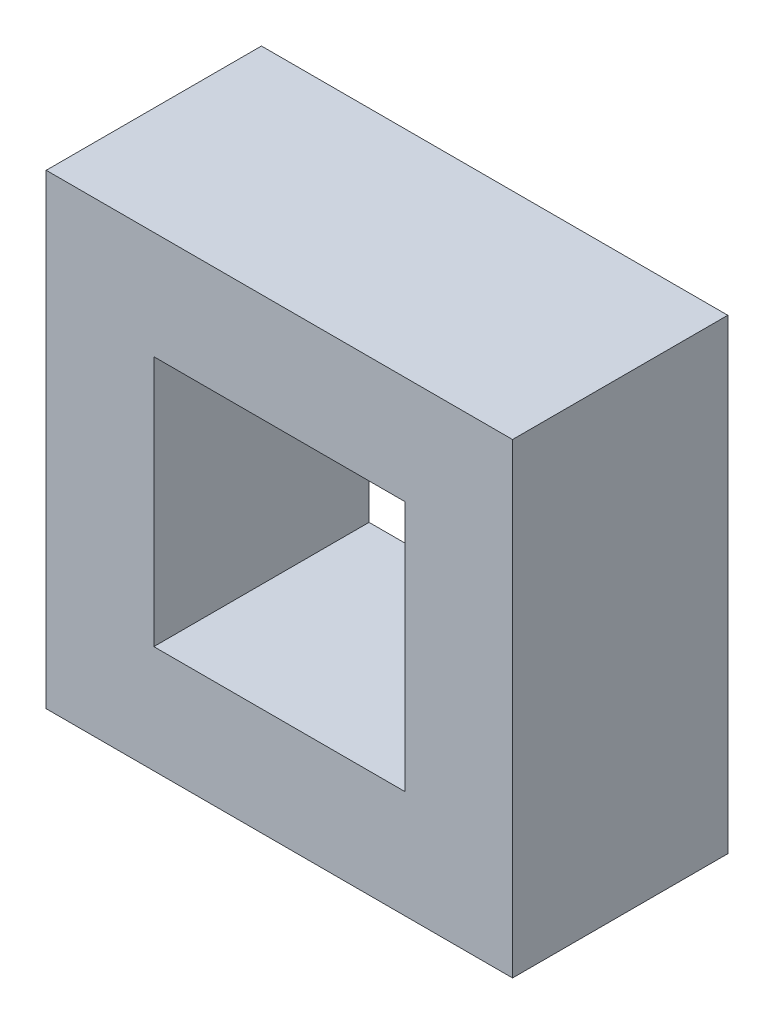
ISO-10303-21;
HEADER;
FILE_DESCRIPTION(('STEP AP214'),'2;1');
FILE_NAME('part.step','',(''),(''),'','','');
FILE_SCHEMA(('AUTOMOTIVE_DESIGN { 1 0 10303 214 1 1 1 1 }'));
ENDSEC;
DATA;
#1=APPLICATION_CONTEXT('core data for automotive mechanical design processes');
#2=APPLICATION_PROTOCOL_DEFINITION('international standard','automotive_design',2000,#1);
#3=PRODUCT_CONTEXT('',#1,'mechanical');
#4=PRODUCT('Part','Part','',(#3));
#5=PRODUCT_RELATED_PRODUCT_CATEGORY('part','',(#4));
#6=PRODUCT_DEFINITION_FORMATION('','',#4);
#7=PRODUCT_DEFINITION_CONTEXT('part definition',#1,'design');
#8=PRODUCT_DEFINITION('design','',#6,#7);
#9=PRODUCT_DEFINITION_SHAPE('','',#8);
#10=(LENGTH_UNIT() NAMED_UNIT(*) SI_UNIT(.MILLI.,.METRE.));
#11=(NAMED_UNIT(*) PLANE_ANGLE_UNIT() SI_UNIT($,.RADIAN.));
#12=(NAMED_UNIT(*) SI_UNIT($,.STERADIAN.) SOLID_ANGLE_UNIT());
#13=UNCERTAINTY_MEASURE_WITH_UNIT(LENGTH_MEASURE(1.E-05),#10,'distance_accuracy_value','');
#14=(GEOMETRIC_REPRESENTATION_CONTEXT(3) GLOBAL_UNCERTAINTY_ASSIGNED_CONTEXT((#13)) GLOBAL_UNIT_ASSIGNED_CONTEXT((#10,
#11,#12)) REPRESENTATION_CONTEXT('',''));
#15=CARTESIAN_POINT('',(0.,0.,0.));
#16=DIRECTION('',(0.,0.,1.));
#17=DIRECTION('',(1.,0.,0.));
#18=AXIS2_PLACEMENT_3D('',#15,#16,#17);
#19=CARTESIAN_POINT('',(330.2,-330.2,304.8));
#20=DIRECTION('',(0.,0.,1.));
#21=DIRECTION('',(1.,0.,0.));
#22=AXIS2_PLACEMENT_3D('',#19,#20,#21);
#23=PLANE('',#22);
#24=DIRECTION('',(0.,1.,0.));
#25=VECTOR('',#24,1.);
#26=CARTESIAN_POINT('',(330.2,330.2,304.8));
#27=LINE('',#26,#25);
#28=CARTESIAN_POINT('',(330.2,-330.2,304.8));
#29=VERTEX_POINT('',#28);
#30=CARTESIAN_POINT('',(330.2,330.2,304.8));
#31=VERTEX_POINT('',#30);
#32=EDGE_CURVE('E132',#29,#31,#27,.T.);
#33=ORIENTED_EDGE('',*,*,#32,.T.);
#34=DIRECTION('',(-1.,0.,0.));
#35=VECTOR('',#34,1.);
#36=CARTESIAN_POINT('',(-330.2,330.2,304.8));
#37=LINE('',#36,#35);
#38=CARTESIAN_POINT('',(-330.2,330.2,304.8));
#39=VERTEX_POINT('',#38);
#40=EDGE_CURVE('E135',#31,#39,#37,.T.);
#41=ORIENTED_EDGE('',*,*,#40,.T.);
#42=DIRECTION('',(0.,-1.,0.));
#43=VECTOR('',#42,1.);
#44=CARTESIAN_POINT('',(-330.2,330.2,304.8));
#45=LINE('',#44,#43);
#46=CARTESIAN_POINT('',(-330.2,-330.2,304.8));
#47=VERTEX_POINT('',#46);
#48=EDGE_CURVE('E138',#39,#47,#45,.T.);
#49=ORIENTED_EDGE('',*,*,#48,.T.);
#50=DIRECTION('',(1.,0.,0.));
#51=VECTOR('',#50,1.);
#52=CARTESIAN_POINT('',(-330.2,-330.2,304.8));
#53=LINE('',#52,#51);
#54=EDGE_CURVE('E140',#47,#29,#53,.T.);
#55=ORIENTED_EDGE('',*,*,#54,.T.);
#56=EDGE_LOOP('',(#33,#41,#49,#55));
#57=FACE_BOUND('',#56,.T.);
#58=DIRECTION('',(-1.,0.,0.));
#59=VECTOR('',#58,1.);
#60=CARTESIAN_POINT('',(-177.8,177.8,304.8));
#61=LINE('',#60,#59);
#62=CARTESIAN_POINT('',(177.8,177.8,304.8));
#63=VERTEX_POINT('',#62);
#64=CARTESIAN_POINT('',(-177.8,177.8,304.8));
#65=VERTEX_POINT('',#64);
#66=EDGE_CURVE('E104',#63,#65,#61,.T.);
#67=ORIENTED_EDGE('',*,*,#66,.F.);
#68=DIRECTION('',(0.,1.,0.));
#69=VECTOR('',#68,1.);
#70=CARTESIAN_POINT('',(177.8,177.8,304.8));
#71=LINE('',#70,#69);
#72=CARTESIAN_POINT('',(177.8,-177.8,304.8));
#73=VERTEX_POINT('',#72);
#74=EDGE_CURVE('E96',#73,#63,#71,.T.);
#75=ORIENTED_EDGE('',*,*,#74,.F.);
#76=DIRECTION('',(1.,0.,0.));
#77=VECTOR('',#76,1.);
#78=CARTESIAN_POINT('',(-177.8,-177.8,304.8));
#79=LINE('',#78,#77);
#80=CARTESIAN_POINT('',(-177.8,-177.8,304.8));
#81=VERTEX_POINT('',#80);
#82=EDGE_CURVE('E118',#81,#73,#79,.T.);
#83=ORIENTED_EDGE('',*,*,#82,.F.);
#84=DIRECTION('',(0.,-1.,0.));
#85=VECTOR('',#84,1.);
#86=CARTESIAN_POINT('',(-177.8,177.8,304.8));
#87=LINE('',#86,#85);
#88=EDGE_CURVE('E116',#65,#81,#87,.T.);
#89=ORIENTED_EDGE('',*,*,#88,.F.);
#90=EDGE_LOOP('',(#67,#75,#83,#89));
#91=FACE_BOUND('',#90,.T.);
#92=ADVANCED_FACE('F31',(#57,#91),#23,.T.);
#93=CARTESIAN_POINT('',(330.2,-330.2,0.));
#94=DIRECTION('',(0.,0.,1.));
#95=DIRECTION('',(1.,0.,0.));
#96=AXIS2_PLACEMENT_3D('',#93,#94,#95);
#97=PLANE('',#96);
#98=DIRECTION('',(0.,1.,0.));
#99=VECTOR('',#98,1.);
#100=CARTESIAN_POINT('',(330.2,330.2,0.));
#101=LINE('',#100,#99);
#102=CARTESIAN_POINT('',(330.2,-330.2,0.));
#103=VERTEX_POINT('',#102);
#104=CARTESIAN_POINT('',(330.2,330.2,0.));
#105=VERTEX_POINT('',#104);
#106=EDGE_CURVE('E112',#103,#105,#101,.T.);
#107=ORIENTED_EDGE('',*,*,#106,.F.);
#108=DIRECTION('',(1.,0.,0.));
#109=VECTOR('',#108,1.);
#110=CARTESIAN_POINT('',(-330.2,-330.2,0.));
#111=LINE('',#110,#109);
#112=CARTESIAN_POINT('',(-330.2,-330.2,0.));
#113=VERTEX_POINT('',#112);
#114=EDGE_CURVE('E136',#113,#103,#111,.T.);
#115=ORIENTED_EDGE('',*,*,#114,.F.);
#116=DIRECTION('',(0.,-1.,0.));
#117=VECTOR('',#116,1.);
#118=CARTESIAN_POINT('',(-330.2,330.2,0.));
#119=LINE('',#118,#117);
#120=CARTESIAN_POINT('',(-330.2,330.2,0.));
#121=VERTEX_POINT('',#120);
#122=EDGE_CURVE('E147',#121,#113,#119,.T.);
#123=ORIENTED_EDGE('',*,*,#122,.F.);
#124=DIRECTION('',(-1.,0.,0.));
#125=VECTOR('',#124,1.);
#126=CARTESIAN_POINT('',(-330.2,330.2,0.));
#127=LINE('',#126,#125);
#128=EDGE_CURVE('E145',#105,#121,#127,.T.);
#129=ORIENTED_EDGE('',*,*,#128,.F.);
#130=EDGE_LOOP('',(#107,#115,#123,#129));
#131=FACE_BOUND('',#130,.T.);
#132=DIRECTION('',(0.,1.,0.));
#133=VECTOR('',#132,1.);
#134=CARTESIAN_POINT('',(177.8,177.8,0.));
#135=LINE('',#134,#133);
#136=CARTESIAN_POINT('',(177.8,-177.8,0.));
#137=VERTEX_POINT('',#136);
#138=CARTESIAN_POINT('',(177.8,177.8,0.));
#139=VERTEX_POINT('',#138);
#140=EDGE_CURVE('E54',#137,#139,#135,.T.);
#141=ORIENTED_EDGE('',*,*,#140,.T.);
#142=DIRECTION('',(-1.,0.,0.));
#143=VECTOR('',#142,1.);
#144=CARTESIAN_POINT('',(-177.8,177.8,0.));
#145=LINE('',#144,#143);
#146=CARTESIAN_POINT('',(-177.8,177.8,0.));
#147=VERTEX_POINT('',#146);
#148=EDGE_CURVE('E111',#139,#147,#145,.T.);
#149=ORIENTED_EDGE('',*,*,#148,.T.);
#150=DIRECTION('',(0.,-1.,0.));
#151=VECTOR('',#150,1.);
#152=CARTESIAN_POINT('',(-177.8,177.8,0.));
#153=LINE('',#152,#151);
#154=CARTESIAN_POINT('',(-177.8,-177.8,0.));
#155=VERTEX_POINT('',#154);
#156=EDGE_CURVE('E124',#147,#155,#153,.T.);
#157=ORIENTED_EDGE('',*,*,#156,.T.);
#158=DIRECTION('',(1.,0.,0.));
#159=VECTOR('',#158,1.);
#160=CARTESIAN_POINT('',(-177.8,-177.8,0.));
#161=LINE('',#160,#159);
#162=EDGE_CURVE('E105',#155,#137,#161,.T.);
#163=ORIENTED_EDGE('',*,*,#162,.T.);
#164=EDGE_LOOP('',(#141,#149,#157,#163));
#165=FACE_BOUND('',#164,.T.);
#166=ADVANCED_FACE('F165',(#131,#165),#97,.F.);
#167=CARTESIAN_POINT('',(330.2,330.2,304.8));
#168=DIRECTION('',(-1.,0.,0.));
#169=DIRECTION('',(0.,-1.,0.));
#170=AXIS2_PLACEMENT_3D('',#167,#168,#169);
#171=PLANE('',#170);
#172=ORIENTED_EDGE('',*,*,#106,.T.);
#173=DIRECTION('',(0.,0.,-1.));
#174=VECTOR('',#173,1.);
#175=CARTESIAN_POINT('',(330.2,330.2,304.8));
#176=LINE('',#175,#174);
#177=EDGE_CURVE('E11',#31,#105,#176,.T.);
#178=ORIENTED_EDGE('',*,*,#177,.F.);
#179=ORIENTED_EDGE('',*,*,#32,.F.);
#180=DIRECTION('',(0.,0.,-1.));
#181=VECTOR('',#180,1.);
#182=CARTESIAN_POINT('',(330.2,-330.2,304.8));
#183=LINE('',#182,#181);
#184=EDGE_CURVE('E142',#29,#103,#183,.T.);
#185=ORIENTED_EDGE('',*,*,#184,.T.);
#186=EDGE_LOOP('',(#172,#178,#179,#185));
#187=FACE_BOUND('',#186,.T.);
#188=ADVANCED_FACE('F33',(#187),#171,.F.);
#189=CARTESIAN_POINT('',(-330.2,330.2,304.8));
#190=DIRECTION('',(0.,-1.,0.));
#191=DIRECTION('',(0.,0.,-1.));
#192=AXIS2_PLACEMENT_3D('',#189,#190,#191);
#193=PLANE('',#192);
#194=ORIENTED_EDGE('',*,*,#128,.T.);
#195=DIRECTION('',(0.,0.,-1.));
#196=VECTOR('',#195,1.);
#197=CARTESIAN_POINT('',(-330.2,330.2,304.8));
#198=LINE('',#197,#196);
#199=EDGE_CURVE('E39',#39,#121,#198,.T.);
#200=ORIENTED_EDGE('',*,*,#199,.F.);
#201=ORIENTED_EDGE('',*,*,#40,.F.);
#202=ORIENTED_EDGE('',*,*,#177,.T.);
#203=EDGE_LOOP('',(#194,#200,#201,#202));
#204=FACE_BOUND('',#203,.T.);
#205=ADVANCED_FACE('F175',(#204),#193,.F.);
#206=CARTESIAN_POINT('',(-330.2,330.2,304.8));
#207=DIRECTION('',(1.,0.,0.));
#208=DIRECTION('',(0.,0.,-1.));
#209=AXIS2_PLACEMENT_3D('',#206,#207,#208);
#210=PLANE('',#209);
#211=ORIENTED_EDGE('',*,*,#122,.T.);
#212=DIRECTION('',(0.,0.,-1.));
#213=VECTOR('',#212,1.);
#214=CARTESIAN_POINT('',(-330.2,-330.2,304.8));
#215=LINE('',#214,#213);
#216=EDGE_CURVE('E152',#47,#113,#215,.T.);
#217=ORIENTED_EDGE('',*,*,#216,.F.);
#218=ORIENTED_EDGE('',*,*,#48,.F.);
#219=ORIENTED_EDGE('',*,*,#199,.T.);
#220=EDGE_LOOP('',(#211,#217,#218,#219));
#221=FACE_BOUND('',#220,.T.);
#222=ADVANCED_FACE('F159',(#221),#210,.F.);
#223=CARTESIAN_POINT('',(-330.2,-330.2,304.8));
#224=DIRECTION('',(0.,1.,0.));
#225=DIRECTION('',(-1.,0.,0.));
#226=AXIS2_PLACEMENT_3D('',#223,#224,#225);
#227=PLANE('',#226);
#228=ORIENTED_EDGE('',*,*,#114,.T.);
#229=ORIENTED_EDGE('',*,*,#184,.F.);
#230=ORIENTED_EDGE('',*,*,#54,.F.);
#231=ORIENTED_EDGE('',*,*,#216,.T.);
#232=EDGE_LOOP('',(#228,#229,#230,#231));
#233=FACE_BOUND('',#232,.T.);
#234=ADVANCED_FACE('F169',(#233),#227,.F.);
#235=CARTESIAN_POINT('',(177.8,177.8,304.8));
#236=DIRECTION('',(-1.,0.,0.));
#237=DIRECTION('',(0.,0.,1.));
#238=AXIS2_PLACEMENT_3D('',#235,#236,#237);
#239=PLANE('',#238);
#240=ORIENTED_EDGE('',*,*,#140,.F.);
#241=DIRECTION('',(0.,0.,-1.));
#242=VECTOR('',#241,1.);
#243=CARTESIAN_POINT('',(177.8,-177.8,304.8));
#244=LINE('',#243,#242);
#245=EDGE_CURVE('E100',#73,#137,#244,.T.);
#246=ORIENTED_EDGE('',*,*,#245,.F.);
#247=ORIENTED_EDGE('',*,*,#74,.T.);
#248=DIRECTION('',(0.,0.,-1.));
#249=VECTOR('',#248,1.);
#250=CARTESIAN_POINT('',(177.8,177.8,304.8));
#251=LINE('',#250,#249);
#252=EDGE_CURVE('E99',#63,#139,#251,.T.);
#253=ORIENTED_EDGE('',*,*,#252,.T.);
#254=EDGE_LOOP('',(#240,#246,#247,#253));
#255=FACE_BOUND('',#254,.T.);
#256=ADVANCED_FACE('F98',(#255),#239,.T.);
#257=CARTESIAN_POINT('',(-177.8,177.8,304.8));
#258=DIRECTION('',(0.,-1.,0.));
#259=DIRECTION('',(0.,0.,-1.));
#260=AXIS2_PLACEMENT_3D('',#257,#258,#259);
#261=PLANE('',#260);
#262=ORIENTED_EDGE('',*,*,#148,.F.);
#263=ORIENTED_EDGE('',*,*,#252,.F.);
#264=ORIENTED_EDGE('',*,*,#66,.T.);
#265=DIRECTION('',(0.,0.,-1.));
#266=VECTOR('',#265,1.);
#267=CARTESIAN_POINT('',(-177.8,177.8,304.8));
#268=LINE('',#267,#266);
#269=EDGE_CURVE('E113',#65,#147,#268,.T.);
#270=ORIENTED_EDGE('',*,*,#269,.T.);
#271=EDGE_LOOP('',(#262,#263,#264,#270));
#272=FACE_BOUND('',#271,.T.);
#273=ADVANCED_FACE('F108',(#272),#261,.T.);
#274=CARTESIAN_POINT('',(-177.8,177.8,304.8));
#275=DIRECTION('',(1.,0.,0.));
#276=DIRECTION('',(0.,0.,-1.));
#277=AXIS2_PLACEMENT_3D('',#274,#275,#276);
#278=PLANE('',#277);
#279=ORIENTED_EDGE('',*,*,#156,.F.);
#280=ORIENTED_EDGE('',*,*,#269,.F.);
#281=ORIENTED_EDGE('',*,*,#88,.T.);
#282=DIRECTION('',(0.,0.,-1.));
#283=VECTOR('',#282,1.);
#284=CARTESIAN_POINT('',(-177.8,-177.8,304.8));
#285=LINE('',#284,#283);
#286=EDGE_CURVE('E46',#81,#155,#285,.T.);
#287=ORIENTED_EDGE('',*,*,#286,.T.);
#288=EDGE_LOOP('',(#279,#280,#281,#287));
#289=FACE_BOUND('',#288,.T.);
#290=ADVANCED_FACE('F198',(#289),#278,.T.);
#291=CARTESIAN_POINT('',(-177.8,-177.8,304.8));
#292=DIRECTION('',(0.,1.,0.));
#293=DIRECTION('',(0.,0.,1.));
#294=AXIS2_PLACEMENT_3D('',#291,#292,#293);
#295=PLANE('',#294);
#296=ORIENTED_EDGE('',*,*,#162,.F.);
#297=ORIENTED_EDGE('',*,*,#286,.F.);
#298=ORIENTED_EDGE('',*,*,#82,.T.);
#299=ORIENTED_EDGE('',*,*,#245,.T.);
#300=EDGE_LOOP('',(#296,#297,#298,#299));
#301=FACE_BOUND('',#300,.T.);
#302=ADVANCED_FACE('F202',(#301),#295,.T.);
#303=CLOSED_SHELL('',(#92,#166,#188,#205,#222,#234,#256,#273,#290,#302));
#304=MANIFOLD_SOLID_BREP('B2',#303);
#305=ADVANCED_BREP_SHAPE_REPRESENTATION('',(#18,#304),#14);
#306=SHAPE_DEFINITION_REPRESENTATION(#9,#305);
ENDSEC;
END-ISO-10303-21;
